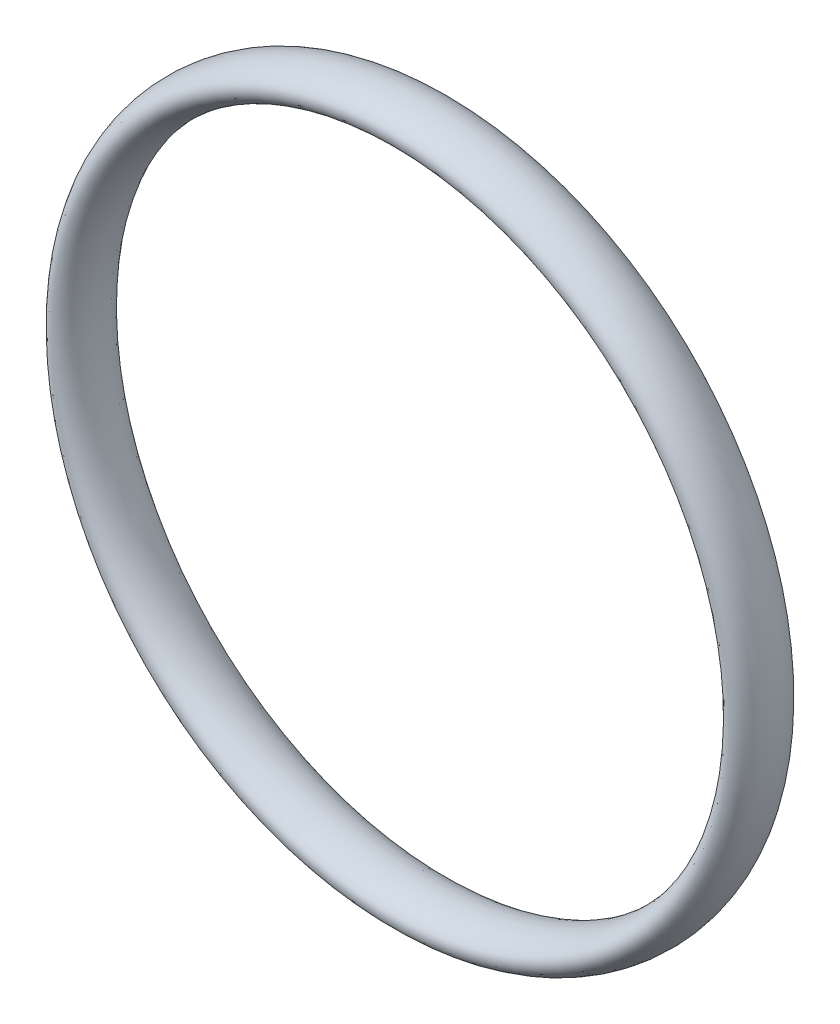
from build123d import *

# Parameters (mm, degrees)
ESQUISSE1_RX = 1.8
ESQUISSE1_RY = 1.05


with BuildPart() as part:
    # Esquisse1 → Base-R_volution (revolve)
    with BuildSketch(Plane(origin=(0, 0, 0), x_dir=(0, 0, -1), z_dir=(1, 0, 0))):
        with Locations(Location((1.8, 20.05), (0, 0, 180))):
            Ellipse(ESQUISSE1_RX, ESQUISSE1_RY)
    revolve(axis=Axis((0, 0, 0), (0, 0, -1)))


solid = part.part
